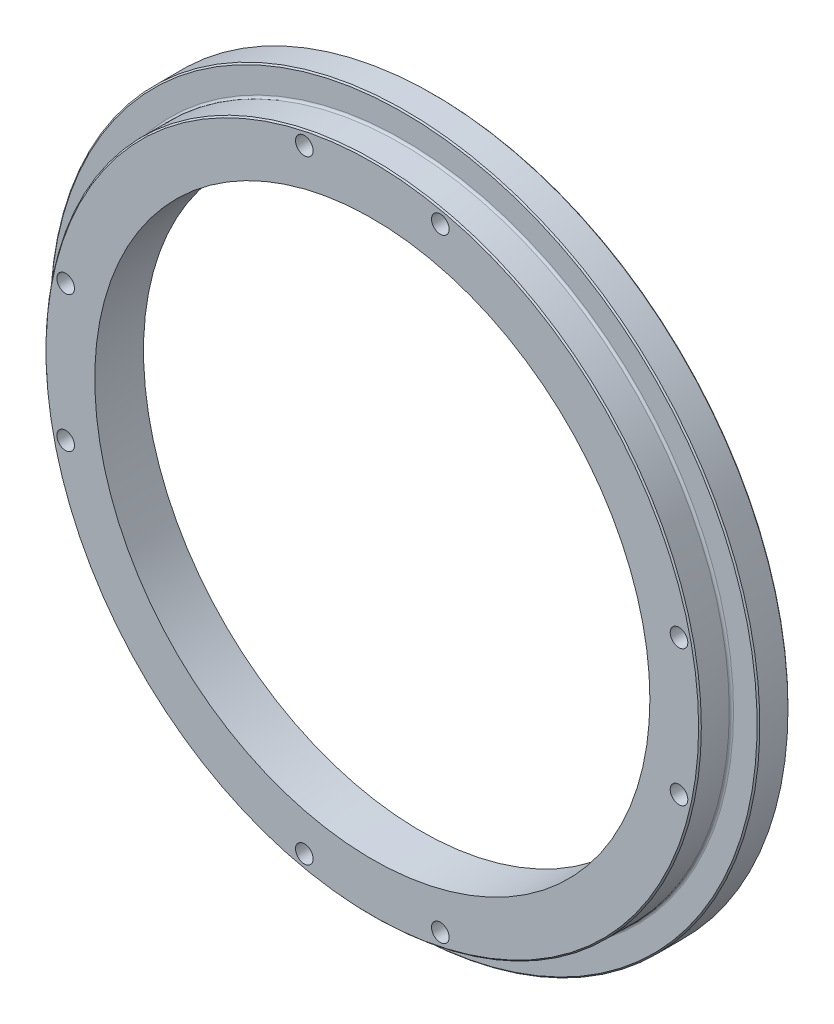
ISO-10303-21;
HEADER;
FILE_DESCRIPTION(('STEP AP214'),'2;1');
FILE_NAME('part.step','',(''),(''),'','','');
FILE_SCHEMA(('AUTOMOTIVE_DESIGN { 1 0 10303 214 1 1 1 1 }'));
ENDSEC;
DATA;
#1=APPLICATION_CONTEXT('core data for automotive mechanical design processes');
#2=APPLICATION_PROTOCOL_DEFINITION('international standard','automotive_design',2000,#1);
#3=PRODUCT_CONTEXT('',#1,'mechanical');
#4=PRODUCT('Part','Part','',(#3));
#5=PRODUCT_RELATED_PRODUCT_CATEGORY('part','',(#4));
#6=PRODUCT_DEFINITION_FORMATION('','',#4);
#7=PRODUCT_DEFINITION_CONTEXT('part definition',#1,'design');
#8=PRODUCT_DEFINITION('design','',#6,#7);
#9=PRODUCT_DEFINITION_SHAPE('','',#8);
#10=(LENGTH_UNIT() NAMED_UNIT(*) SI_UNIT(.MILLI.,.METRE.));
#11=(NAMED_UNIT(*) PLANE_ANGLE_UNIT() SI_UNIT($,.RADIAN.));
#12=(NAMED_UNIT(*) SI_UNIT($,.STERADIAN.) SOLID_ANGLE_UNIT());
#13=UNCERTAINTY_MEASURE_WITH_UNIT(LENGTH_MEASURE(1.E-05),#10,'distance_accuracy_value','');
#14=(GEOMETRIC_REPRESENTATION_CONTEXT(3) GLOBAL_UNCERTAINTY_ASSIGNED_CONTEXT((#13)) GLOBAL_UNIT_ASSIGNED_CONTEXT((#10,
#11,#12)) REPRESENTATION_CONTEXT('',''));
#15=CARTESIAN_POINT('',(0.,0.,0.));
#16=DIRECTION('',(0.,0.,1.));
#17=DIRECTION('',(1.,0.,0.));
#18=AXIS2_PLACEMENT_3D('',#15,#16,#17);
#19=CARTESIAN_POINT('',(0.,0.,23.));
#20=DIRECTION('',(0.,0.,-1.));
#21=DIRECTION('',(-1.,0.,0.));
#22=AXIS2_PLACEMENT_3D('',#19,#20,#21);
#23=CYLINDRICAL_SURFACE('',#22,121.);
#24=CARTESIAN_POINT('',(0.,0.,22.5000000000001));
#25=DIRECTION('',(0.,0.,1.));
#26=DIRECTION('',(1.,0.,0.));
#27=AXIS2_PLACEMENT_3D('',#24,#25,#26);
#28=CIRCLE('',#27,121.);
#29=CARTESIAN_POINT('',(121.,0.,22.5000000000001));
#30=VERTEX_POINT('',#29);
#31=EDGE_CURVE('E10',#30,#30,#28,.F.);
#32=ORIENTED_EDGE('',*,*,#31,.T.);
#33=EDGE_LOOP('',(#32));
#34=FACE_BOUND('',#33,.T.);
#35=CARTESIAN_POINT('',(0.,0.,12.2));
#36=DIRECTION('',(0.,0.,-1.));
#37=DIRECTION('',(-1.,0.,0.));
#38=AXIS2_PLACEMENT_3D('',#35,#36,#37);
#39=CIRCLE('',#38,121.);
#40=CARTESIAN_POINT('',(-121.,0.,12.2));
#41=VERTEX_POINT('',#40);
#42=EDGE_CURVE('E64',#41,#41,#39,.F.);
#43=ORIENTED_EDGE('',*,*,#42,.T.);
#44=EDGE_LOOP('',(#43));
#45=FACE_BOUND('',#44,.T.);
#46=ADVANCED_FACE('F38',(#34,#45),#23,.T.);
#47=CARTESIAN_POINT('',(0.,0.,0.));
#48=DIRECTION('',(0.,0.,1.));
#49=DIRECTION('',(1.,0.,0.));
#50=AXIS2_PLACEMENT_3D('',#47,#48,#49);
#51=PLANE('',#50);
#52=CARTESIAN_POINT('',(0.,0.,0.));
#53=DIRECTION('',(0.,0.,1.));
#54=DIRECTION('',(1.,0.,0.));
#55=AXIS2_PLACEMENT_3D('',#52,#53,#54);
#56=CIRCLE('',#55,130.5);
#57=CARTESIAN_POINT('',(130.5,0.,0.));
#58=VERTEX_POINT('',#57);
#59=EDGE_CURVE('E61',#58,#58,#56,.F.);
#60=ORIENTED_EDGE('',*,*,#59,.T.);
#61=EDGE_LOOP('',(#60));
#62=FACE_BOUND('',#61,.T.);
#63=CARTESIAN_POINT('',(-25.10699521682,113.250336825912,0.));
#64=DIRECTION('',(0.,0.,1.));
#65=DIRECTION('',(1.,0.,0.));
#66=AXIS2_PLACEMENT_3D('',#63,#64,#65);
#67=CIRCLE('',#66,3.25000000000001);
#68=CARTESIAN_POINT('',(-21.85699521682,113.250336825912,0.));
#69=VERTEX_POINT('',#68);
#70=EDGE_CURVE('E73',#69,#69,#67,.T.);
#71=ORIENTED_EDGE('',*,*,#70,.T.);
#72=EDGE_LOOP('',(#71));
#73=FACE_BOUND('',#72,.T.);
#74=CARTESIAN_POINT('',(25.10699521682,113.250336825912,0.));
#75=DIRECTION('',(0.,0.,1.));
#76=DIRECTION('',(-1.,0.,0.));
#77=AXIS2_PLACEMENT_3D('',#74,#75,#76);
#78=CIRCLE('',#77,3.25000000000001);
#79=CARTESIAN_POINT('',(21.85699521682,113.250336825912,0.));
#80=VERTEX_POINT('',#79);
#81=EDGE_CURVE('E77',#80,#80,#78,.T.);
#82=ORIENTED_EDGE('',*,*,#81,.T.);
#83=EDGE_LOOP('',(#82));
#84=FACE_BOUND('',#83,.T.);
#85=CARTESIAN_POINT('',(113.250336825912,25.1069952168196,0.));
#86=DIRECTION('',(0.,0.,1.));
#87=DIRECTION('',(0.,-1.,0.));
#88=AXIS2_PLACEMENT_3D('',#85,#86,#87);
#89=CIRCLE('',#88,3.25000000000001);
#90=CARTESIAN_POINT('',(113.250336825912,21.8569952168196,0.));
#91=VERTEX_POINT('',#90);
#92=EDGE_CURVE('E83',#91,#91,#89,.T.);
#93=ORIENTED_EDGE('',*,*,#92,.T.);
#94=EDGE_LOOP('',(#93));
#95=FACE_BOUND('',#94,.T.);
#96=CARTESIAN_POINT('',(113.250336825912,-25.1069952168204,0.));
#97=DIRECTION('',(0.,0.,1.));
#98=DIRECTION('',(0.,1.,0.));
#99=AXIS2_PLACEMENT_3D('',#96,#97,#98);
#100=CIRCLE('',#99,3.25000000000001);
#101=CARTESIAN_POINT('',(113.250336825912,-21.8569952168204,0.));
#102=VERTEX_POINT('',#101);
#103=EDGE_CURVE('E89',#102,#102,#100,.T.);
#104=ORIENTED_EDGE('',*,*,#103,.T.);
#105=EDGE_LOOP('',(#104));
#106=FACE_BOUND('',#105,.T.);
#107=CARTESIAN_POINT('',(25.1069952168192,-113.250336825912,0.));
#108=DIRECTION('',(0.,0.,1.));
#109=DIRECTION('',(-1.,0.,0.));
#110=AXIS2_PLACEMENT_3D('',#107,#108,#109);
#111=CIRCLE('',#110,3.25000000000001);
#112=CARTESIAN_POINT('',(21.8569952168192,-113.250336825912,0.));
#113=VERTEX_POINT('',#112);
#114=EDGE_CURVE('E95',#113,#113,#111,.T.);
#115=ORIENTED_EDGE('',*,*,#114,.T.);
#116=EDGE_LOOP('',(#115));
#117=FACE_BOUND('',#116,.T.);
#118=CARTESIAN_POINT('',(-25.1069952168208,-113.250336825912,0.));
#119=DIRECTION('',(0.,0.,1.));
#120=DIRECTION('',(1.,0.,0.));
#121=AXIS2_PLACEMENT_3D('',#118,#119,#120);
#122=CIRCLE('',#121,3.25000000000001);
#123=CARTESIAN_POINT('',(-21.8569952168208,-113.250336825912,0.));
#124=VERTEX_POINT('',#123);
#125=EDGE_CURVE('E101',#124,#124,#122,.T.);
#126=ORIENTED_EDGE('',*,*,#125,.T.);
#127=EDGE_LOOP('',(#126));
#128=FACE_BOUND('',#127,.T.);
#129=CARTESIAN_POINT('',(-113.250336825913,-25.1069952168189,0.));
#130=DIRECTION('',(0.,0.,1.));
#131=DIRECTION('',(0.,1.,0.));
#132=AXIS2_PLACEMENT_3D('',#129,#130,#131);
#133=CIRCLE('',#132,3.25000000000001);
#134=CARTESIAN_POINT('',(-113.250336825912,-21.8569952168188,0.));
#135=VERTEX_POINT('',#134);
#136=EDGE_CURVE('E107',#135,#135,#133,.T.);
#137=ORIENTED_EDGE('',*,*,#136,.T.);
#138=EDGE_LOOP('',(#137));
#139=FACE_BOUND('',#138,.T.);
#140=CARTESIAN_POINT('',(-113.250336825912,25.1069952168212,0.));
#141=DIRECTION('',(0.,0.,1.));
#142=DIRECTION('',(0.,-1.,0.));
#143=AXIS2_PLACEMENT_3D('',#140,#141,#142);
#144=CIRCLE('',#143,3.25000000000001);
#145=CARTESIAN_POINT('',(-113.250336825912,21.8569952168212,0.));
#146=VERTEX_POINT('',#145);
#147=EDGE_CURVE('E113',#146,#146,#144,.T.);
#148=ORIENTED_EDGE('',*,*,#147,.T.);
#149=EDGE_LOOP('',(#148));
#150=FACE_BOUND('',#149,.T.);
#151=CARTESIAN_POINT('',(0.,0.,0.));
#152=DIRECTION('',(0.,0.,1.));
#153=DIRECTION('',(1.,0.,0.));
#154=AXIS2_PLACEMENT_3D('',#151,#152,#153);
#155=CIRCLE('',#154,109.75);
#156=CARTESIAN_POINT('',(109.75,0.,0.));
#157=VERTEX_POINT('',#156);
#158=EDGE_CURVE('E122',#157,#157,#155,.T.);
#159=ORIENTED_EDGE('',*,*,#158,.T.);
#160=EDGE_LOOP('',(#159));
#161=FACE_BOUND('',#160,.T.);
#162=ADVANCED_FACE('F142',(#62,#73,#84,#95,#106,#117,#128,#139,#150,#161),#51,.F.);
#163=CARTESIAN_POINT('',(0.,0.,23.));
#164=DIRECTION('',(0.,0.,1.));
#165=DIRECTION('',(1.,0.,0.));
#166=AXIS2_PLACEMENT_3D('',#163,#164,#165);
#167=PLANE('',#166);
#168=CARTESIAN_POINT('',(0.,0.,23.));
#169=DIRECTION('',(0.,0.,1.));
#170=DIRECTION('',(1.,0.,0.));
#171=AXIS2_PLACEMENT_3D('',#168,#169,#170);
#172=CIRCLE('',#171,120.5);
#173=CARTESIAN_POINT('',(120.5,0.,23.));
#174=VERTEX_POINT('',#173);
#175=EDGE_CURVE('E45',#174,#174,#172,.T.);
#176=ORIENTED_EDGE('',*,*,#175,.T.);
#177=EDGE_LOOP('',(#176));
#178=FACE_BOUND('',#177,.T.);
#179=CARTESIAN_POINT('',(-113.250336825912,25.1069952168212,23.));
#180=DIRECTION('',(0.,0.,1.));
#181=DIRECTION('',(0.,-1.,0.));
#182=AXIS2_PLACEMENT_3D('',#179,#180,#181);
#183=CIRCLE('',#182,3.25000000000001);
#184=CARTESIAN_POINT('',(-113.250336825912,21.8569952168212,23.));
#185=VERTEX_POINT('',#184);
#186=EDGE_CURVE('E116',#185,#185,#183,.T.);
#187=ORIENTED_EDGE('',*,*,#186,.F.);
#188=EDGE_LOOP('',(#187));
#189=FACE_BOUND('',#188,.T.);
#190=CARTESIAN_POINT('',(-113.250336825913,-25.1069952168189,23.));
#191=DIRECTION('',(0.,0.,1.));
#192=DIRECTION('',(0.,1.,0.));
#193=AXIS2_PLACEMENT_3D('',#190,#191,#192);
#194=CIRCLE('',#193,3.25000000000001);
#195=CARTESIAN_POINT('',(-113.250336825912,-21.8569952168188,23.));
#196=VERTEX_POINT('',#195);
#197=EDGE_CURVE('E110',#196,#196,#194,.T.);
#198=ORIENTED_EDGE('',*,*,#197,.F.);
#199=EDGE_LOOP('',(#198));
#200=FACE_BOUND('',#199,.T.);
#201=CARTESIAN_POINT('',(-25.1069952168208,-113.250336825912,23.));
#202=DIRECTION('',(0.,0.,1.));
#203=DIRECTION('',(1.,0.,0.));
#204=AXIS2_PLACEMENT_3D('',#201,#202,#203);
#205=CIRCLE('',#204,3.25000000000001);
#206=CARTESIAN_POINT('',(-21.8569952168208,-113.250336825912,23.));
#207=VERTEX_POINT('',#206);
#208=EDGE_CURVE('E104',#207,#207,#205,.T.);
#209=ORIENTED_EDGE('',*,*,#208,.F.);
#210=EDGE_LOOP('',(#209));
#211=FACE_BOUND('',#210,.T.);
#212=CARTESIAN_POINT('',(25.1069952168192,-113.250336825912,23.));
#213=DIRECTION('',(0.,0.,1.));
#214=DIRECTION('',(-1.,0.,0.));
#215=AXIS2_PLACEMENT_3D('',#212,#213,#214);
#216=CIRCLE('',#215,3.25000000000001);
#217=CARTESIAN_POINT('',(21.8569952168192,-113.250336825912,23.));
#218=VERTEX_POINT('',#217);
#219=EDGE_CURVE('E98',#218,#218,#216,.T.);
#220=ORIENTED_EDGE('',*,*,#219,.F.);
#221=EDGE_LOOP('',(#220));
#222=FACE_BOUND('',#221,.T.);
#223=CARTESIAN_POINT('',(113.250336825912,-25.1069952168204,23.));
#224=DIRECTION('',(0.,0.,1.));
#225=DIRECTION('',(0.,1.,0.));
#226=AXIS2_PLACEMENT_3D('',#223,#224,#225);
#227=CIRCLE('',#226,3.25000000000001);
#228=CARTESIAN_POINT('',(113.250336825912,-21.8569952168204,23.));
#229=VERTEX_POINT('',#228);
#230=EDGE_CURVE('E92',#229,#229,#227,.T.);
#231=ORIENTED_EDGE('',*,*,#230,.F.);
#232=EDGE_LOOP('',(#231));
#233=FACE_BOUND('',#232,.T.);
#234=CARTESIAN_POINT('',(113.250336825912,25.1069952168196,23.));
#235=DIRECTION('',(0.,0.,1.));
#236=DIRECTION('',(0.,-1.,0.));
#237=AXIS2_PLACEMENT_3D('',#234,#235,#236);
#238=CIRCLE('',#237,3.25000000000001);
#239=CARTESIAN_POINT('',(113.250336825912,21.8569952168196,23.));
#240=VERTEX_POINT('',#239);
#241=EDGE_CURVE('E86',#240,#240,#238,.T.);
#242=ORIENTED_EDGE('',*,*,#241,.F.);
#243=EDGE_LOOP('',(#242));
#244=FACE_BOUND('',#243,.T.);
#245=CARTESIAN_POINT('',(25.10699521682,113.250336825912,23.));
#246=DIRECTION('',(0.,0.,1.));
#247=DIRECTION('',(-1.,0.,0.));
#248=AXIS2_PLACEMENT_3D('',#245,#246,#247);
#249=CIRCLE('',#248,3.25000000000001);
#250=CARTESIAN_POINT('',(21.85699521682,113.250336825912,23.));
#251=VERTEX_POINT('',#250);
#252=EDGE_CURVE('E80',#251,#251,#249,.T.);
#253=ORIENTED_EDGE('',*,*,#252,.F.);
#254=EDGE_LOOP('',(#253));
#255=FACE_BOUND('',#254,.T.);
#256=CARTESIAN_POINT('',(-25.10699521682,113.250336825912,23.));
#257=DIRECTION('',(0.,0.,1.));
#258=DIRECTION('',(1.,0.,0.));
#259=AXIS2_PLACEMENT_3D('',#256,#257,#258);
#260=CIRCLE('',#259,3.25000000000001);
#261=CARTESIAN_POINT('',(-21.85699521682,113.250336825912,23.));
#262=VERTEX_POINT('',#261);
#263=EDGE_CURVE('E74',#262,#262,#260,.T.);
#264=ORIENTED_EDGE('',*,*,#263,.F.);
#265=EDGE_LOOP('',(#264));
#266=FACE_BOUND('',#265,.T.);
#267=CARTESIAN_POINT('',(0.,0.,23.));
#268=DIRECTION('',(0.,0.,1.));
#269=DIRECTION('',(1.,0.,0.));
#270=AXIS2_PLACEMENT_3D('',#267,#268,#269);
#271=CIRCLE('',#270,102.5);
#272=CARTESIAN_POINT('',(102.5,0.,23.));
#273=VERTEX_POINT('',#272);
#274=EDGE_CURVE('E70',#273,#273,#271,.T.);
#275=ORIENTED_EDGE('',*,*,#274,.F.);
#276=EDGE_LOOP('',(#275));
#277=FACE_BOUND('',#276,.T.);
#278=ADVANCED_FACE('F137',(#178,#189,#200,#211,#222,#233,#244,#255,#266,#277),#167,.T.);
#279=CARTESIAN_POINT('',(0.,0.,23.));
#280=DIRECTION('',(0.,0.,-1.));
#281=DIRECTION('',(-1.,0.,0.));
#282=AXIS2_PLACEMENT_3D('',#279,#280,#281);
#283=CYLINDRICAL_SURFACE('',#282,102.5);
#284=CARTESIAN_POINT('',(0.,0.,5.));
#285=DIRECTION('',(0.,0.,1.));
#286=DIRECTION('',(1.,0.,0.));
#287=AXIS2_PLACEMENT_3D('',#284,#285,#286);
#288=CIRCLE('',#287,102.5);
#289=CARTESIAN_POINT('',(102.5,0.,5.));
#290=VERTEX_POINT('',#289);
#291=EDGE_CURVE('E125',#290,#290,#288,.T.);
#292=ORIENTED_EDGE('',*,*,#291,.F.);
#293=EDGE_LOOP('',(#292));
#294=FACE_BOUND('',#293,.T.);
#295=ORIENTED_EDGE('',*,*,#274,.T.);
#296=EDGE_LOOP('',(#295));
#297=FACE_BOUND('',#296,.T.);
#298=ADVANCED_FACE('F133',(#294,#297),#283,.F.);
#299=CARTESIAN_POINT('',(-25.10699521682,113.250336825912,0.));
#300=DIRECTION('',(0.,0.,1.));
#301=DIRECTION('',(1.,0.,0.));
#302=AXIS2_PLACEMENT_3D('',#299,#300,#301);
#303=CYLINDRICAL_SURFACE('',#302,3.25000000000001);
#304=ORIENTED_EDGE('',*,*,#70,.F.);
#305=EDGE_LOOP('',(#304));
#306=FACE_BOUND('',#305,.T.);
#307=ORIENTED_EDGE('',*,*,#263,.T.);
#308=EDGE_LOOP('',(#307));
#309=FACE_BOUND('',#308,.T.);
#310=ADVANCED_FACE('F136',(#306,#309),#303,.F.);
#311=CARTESIAN_POINT('',(25.10699521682,113.250336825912,0.));
#312=DIRECTION('',(0.,0.,1.));
#313=DIRECTION('',(1.,0.,0.));
#314=AXIS2_PLACEMENT_3D('',#311,#312,#313);
#315=CYLINDRICAL_SURFACE('',#314,3.25000000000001);
#316=ORIENTED_EDGE('',*,*,#81,.F.);
#317=EDGE_LOOP('',(#316));
#318=FACE_BOUND('',#317,.T.);
#319=ORIENTED_EDGE('',*,*,#252,.T.);
#320=EDGE_LOOP('',(#319));
#321=FACE_BOUND('',#320,.T.);
#322=ADVANCED_FACE('F215',(#318,#321),#315,.F.);
#323=CARTESIAN_POINT('',(113.250336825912,25.1069952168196,0.));
#324=DIRECTION('',(0.,0.,1.));
#325=DIRECTION('',(1.,0.,0.));
#326=AXIS2_PLACEMENT_3D('',#323,#324,#325);
#327=CYLINDRICAL_SURFACE('',#326,3.25000000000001);
#328=ORIENTED_EDGE('',*,*,#92,.F.);
#329=EDGE_LOOP('',(#328));
#330=FACE_BOUND('',#329,.T.);
#331=ORIENTED_EDGE('',*,*,#241,.T.);
#332=EDGE_LOOP('',(#331));
#333=FACE_BOUND('',#332,.T.);
#334=ADVANCED_FACE('F211',(#330,#333),#327,.F.);
#335=CARTESIAN_POINT('',(113.250336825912,-25.1069952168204,0.));
#336=DIRECTION('',(0.,0.,1.));
#337=DIRECTION('',(1.,0.,0.));
#338=AXIS2_PLACEMENT_3D('',#335,#336,#337);
#339=CYLINDRICAL_SURFACE('',#338,3.25000000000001);
#340=ORIENTED_EDGE('',*,*,#103,.F.);
#341=EDGE_LOOP('',(#340));
#342=FACE_BOUND('',#341,.T.);
#343=ORIENTED_EDGE('',*,*,#230,.T.);
#344=EDGE_LOOP('',(#343));
#345=FACE_BOUND('',#344,.T.);
#346=ADVANCED_FACE('F207',(#342,#345),#339,.F.);
#347=CARTESIAN_POINT('',(25.1069952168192,-113.250336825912,0.));
#348=DIRECTION('',(0.,0.,1.));
#349=DIRECTION('',(1.,0.,0.));
#350=AXIS2_PLACEMENT_3D('',#347,#348,#349);
#351=CYLINDRICAL_SURFACE('',#350,3.25000000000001);
#352=ORIENTED_EDGE('',*,*,#114,.F.);
#353=EDGE_LOOP('',(#352));
#354=FACE_BOUND('',#353,.T.);
#355=ORIENTED_EDGE('',*,*,#219,.T.);
#356=EDGE_LOOP('',(#355));
#357=FACE_BOUND('',#356,.T.);
#358=ADVANCED_FACE('F203',(#354,#357),#351,.F.);
#359=CARTESIAN_POINT('',(-25.1069952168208,-113.250336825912,0.));
#360=DIRECTION('',(0.,0.,1.));
#361=DIRECTION('',(1.,0.,0.));
#362=AXIS2_PLACEMENT_3D('',#359,#360,#361);
#363=CYLINDRICAL_SURFACE('',#362,3.25000000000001);
#364=ORIENTED_EDGE('',*,*,#125,.F.);
#365=EDGE_LOOP('',(#364));
#366=FACE_BOUND('',#365,.T.);
#367=ORIENTED_EDGE('',*,*,#208,.T.);
#368=EDGE_LOOP('',(#367));
#369=FACE_BOUND('',#368,.T.);
#370=ADVANCED_FACE('F199',(#366,#369),#363,.F.);
#371=CARTESIAN_POINT('',(-113.250336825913,-25.1069952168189,0.));
#372=DIRECTION('',(0.,0.,1.));
#373=DIRECTION('',(1.,0.,0.));
#374=AXIS2_PLACEMENT_3D('',#371,#372,#373);
#375=CYLINDRICAL_SURFACE('',#374,3.25000000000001);
#376=ORIENTED_EDGE('',*,*,#136,.F.);
#377=EDGE_LOOP('',(#376));
#378=FACE_BOUND('',#377,.T.);
#379=ORIENTED_EDGE('',*,*,#197,.T.);
#380=EDGE_LOOP('',(#379));
#381=FACE_BOUND('',#380,.T.);
#382=ADVANCED_FACE('F195',(#378,#381),#375,.F.);
#383=CARTESIAN_POINT('',(-113.250336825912,25.1069952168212,0.));
#384=DIRECTION('',(0.,0.,1.));
#385=DIRECTION('',(1.,0.,0.));
#386=AXIS2_PLACEMENT_3D('',#383,#384,#385);
#387=CYLINDRICAL_SURFACE('',#386,3.25000000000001);
#388=ORIENTED_EDGE('',*,*,#147,.F.);
#389=EDGE_LOOP('',(#388));
#390=FACE_BOUND('',#389,.T.);
#391=ORIENTED_EDGE('',*,*,#186,.T.);
#392=EDGE_LOOP('',(#391));
#393=FACE_BOUND('',#392,.T.);
#394=ADVANCED_FACE('F190',(#390,#393),#387,.F.);
#395=CARTESIAN_POINT('',(0.,0.,5.));
#396=DIRECTION('',(0.,0.,1.));
#397=DIRECTION('',(1.,0.,0.));
#398=AXIS2_PLACEMENT_3D('',#395,#396,#397);
#399=PLANE('',#398);
#400=CARTESIAN_POINT('',(0.,0.,5.));
#401=DIRECTION('',(0.,0.,1.));
#402=DIRECTION('',(1.,0.,0.));
#403=AXIS2_PLACEMENT_3D('',#400,#401,#402);
#404=CIRCLE('',#403,109.75);
#405=CARTESIAN_POINT('',(109.75,0.,5.));
#406=VERTEX_POINT('',#405);
#407=EDGE_CURVE('E119',#406,#406,#404,.T.);
#408=ORIENTED_EDGE('',*,*,#407,.F.);
#409=EDGE_LOOP('',(#408));
#410=FACE_BOUND('',#409,.T.);
#411=ORIENTED_EDGE('',*,*,#291,.T.);
#412=EDGE_LOOP('',(#411));
#413=FACE_BOUND('',#412,.T.);
#414=ADVANCED_FACE('F131',(#410,#413),#399,.F.);
#415=CARTESIAN_POINT('',(0.,0.,5.));
#416=DIRECTION('',(0.,0.,-1.));
#417=DIRECTION('',(-1.,0.,0.));
#418=AXIS2_PLACEMENT_3D('',#415,#416,#417);
#419=CYLINDRICAL_SURFACE('',#418,109.75);
#420=ORIENTED_EDGE('',*,*,#407,.T.);
#421=EDGE_LOOP('',(#420));
#422=FACE_BOUND('',#421,.T.);
#423=ORIENTED_EDGE('',*,*,#158,.F.);
#424=EDGE_LOOP('',(#423));
#425=FACE_BOUND('',#424,.T.);
#426=ADVANCED_FACE('F177',(#422,#425),#419,.F.);
#427=CARTESIAN_POINT('',(0.,0.,11.4));
#428=DIRECTION('',(0.,0.,-1.));
#429=DIRECTION('',(-1.,0.,0.));
#430=AXIS2_PLACEMENT_3D('',#427,#428,#429);
#431=CYLINDRICAL_SURFACE('',#430,131.);
#432=CARTESIAN_POINT('',(0.,0.,0.500000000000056));
#433=DIRECTION('',(0.,0.,1.));
#434=DIRECTION('',(1.,0.,0.));
#435=AXIS2_PLACEMENT_3D('',#432,#433,#434);
#436=CIRCLE('',#435,131.);
#437=CARTESIAN_POINT('',(131.,0.,0.500000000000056));
#438=VERTEX_POINT('',#437);
#439=EDGE_CURVE('E53',#438,#438,#436,.T.);
#440=ORIENTED_EDGE('',*,*,#439,.T.);
#441=EDGE_LOOP('',(#440));
#442=FACE_BOUND('',#441,.T.);
#443=CARTESIAN_POINT('',(0.,0.,10.9));
#444=DIRECTION('',(0.,0.,-1.));
#445=DIRECTION('',(-1.,0.,0.));
#446=AXIS2_PLACEMENT_3D('',#443,#444,#445);
#447=CIRCLE('',#446,131.);
#448=CARTESIAN_POINT('',(-131.,0.,10.9));
#449=VERTEX_POINT('',#448);
#450=EDGE_CURVE('E58',#449,#449,#447,.T.);
#451=ORIENTED_EDGE('',*,*,#450,.T.);
#452=EDGE_LOOP('',(#451));
#453=FACE_BOUND('',#452,.T.);
#454=ADVANCED_FACE('F175',(#442,#453),#431,.T.);
#455=CARTESIAN_POINT('',(0.,0.,11.4));
#456=DIRECTION('',(0.,0.,-1.));
#457=DIRECTION('',(-1.,0.,0.));
#458=AXIS2_PLACEMENT_3D('',#455,#456,#457);
#459=PLANE('',#458);
#460=CARTESIAN_POINT('',(0.,0.,11.4));
#461=DIRECTION('',(0.,0.,-1.));
#462=DIRECTION('',(-1.,0.,0.));
#463=AXIS2_PLACEMENT_3D('',#460,#461,#462);
#464=CIRCLE('',#463,130.5);
#465=CARTESIAN_POINT('',(-130.5,0.,11.4));
#466=VERTEX_POINT('',#465);
#467=EDGE_CURVE('E49',#466,#466,#464,.F.);
#468=ORIENTED_EDGE('',*,*,#467,.T.);
#469=EDGE_LOOP('',(#468));
#470=FACE_BOUND('',#469,.T.);
#471=CARTESIAN_POINT('',(0.,0.,11.4));
#472=DIRECTION('',(0.,0.,-1.));
#473=DIRECTION('',(-1.,0.,0.));
#474=AXIS2_PLACEMENT_3D('',#471,#472,#473);
#475=CIRCLE('',#474,121.8);
#476=CARTESIAN_POINT('',(-121.8,0.,11.4));
#477=VERTEX_POINT('',#476);
#478=EDGE_CURVE('E67',#477,#477,#475,.T.);
#479=ORIENTED_EDGE('',*,*,#478,.T.);
#480=EDGE_LOOP('',(#479));
#481=FACE_BOUND('',#480,.T.);
#482=ADVANCED_FACE('F160',(#470,#481),#459,.F.);
#483=CARTESIAN_POINT('',(0.,0.,12.2));
#484=DIRECTION('',(0.,0.,-1.));
#485=DIRECTION('',(-1.,0.,0.));
#486=AXIS2_PLACEMENT_3D('',#483,#484,#485);
#487=TOROIDAL_SURFACE('',#486,121.8,0.8);
#488=ORIENTED_EDGE('',*,*,#42,.F.);
#489=EDGE_LOOP('',(#488));
#490=FACE_BOUND('',#489,.T.);
#491=ORIENTED_EDGE('',*,*,#478,.F.);
#492=EDGE_LOOP('',(#491));
#493=FACE_BOUND('',#492,.T.);
#494=ADVANCED_FACE('F156',(#490,#493),#487,.F.);
#495=CARTESIAN_POINT('',(0.,0.,0.));
#496=DIRECTION('',(0.,0.,1.));
#497=DIRECTION('',(1.,0.,0.));
#498=AXIS2_PLACEMENT_3D('',#495,#496,#497);
#499=CONICAL_SURFACE('',#498,130.5,0.785398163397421);
#500=ORIENTED_EDGE('',*,*,#439,.F.);
#501=EDGE_LOOP('',(#500));
#502=FACE_BOUND('',#501,.T.);
#503=ORIENTED_EDGE('',*,*,#59,.F.);
#504=EDGE_LOOP('',(#503));
#505=FACE_BOUND('',#504,.T.);
#506=ADVANCED_FACE('F159',(#502,#505),#499,.T.);
#507=CARTESIAN_POINT('',(0.,0.,10.9));
#508=DIRECTION('',(0.,0.,-1.));
#509=DIRECTION('',(-1.,0.,0.));
#510=AXIS2_PLACEMENT_3D('',#507,#508,#509);
#511=CONICAL_SURFACE('',#510,131.,0.785398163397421);
#512=ORIENTED_EDGE('',*,*,#467,.F.);
#513=EDGE_LOOP('',(#512));
#514=FACE_BOUND('',#513,.T.);
#515=ORIENTED_EDGE('',*,*,#450,.F.);
#516=EDGE_LOOP('',(#515));
#517=FACE_BOUND('',#516,.T.);
#518=ADVANCED_FACE('F163',(#514,#517),#511,.T.);
#519=CARTESIAN_POINT('',(0.,0.,23.));
#520=DIRECTION('',(0.,0.,-1.));
#521=DIRECTION('',(-1.,0.,0.));
#522=AXIS2_PLACEMENT_3D('',#519,#520,#521);
#523=CONICAL_SURFACE('',#522,120.5,0.785398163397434);
#524=ORIENTED_EDGE('',*,*,#31,.F.);
#525=EDGE_LOOP('',(#524));
#526=FACE_BOUND('',#525,.T.);
#527=ORIENTED_EDGE('',*,*,#175,.F.);
#528=EDGE_LOOP('',(#527));
#529=FACE_BOUND('',#528,.T.);
#530=ADVANCED_FACE('F40',(#526,#529),#523,.T.);
#531=CLOSED_SHELL('',(#46,#162,#278,#298,#310,#322,#334,#346,#358,#370,#382,#394,#414,#426,#454,
#482,#494,#506,#518,#530));
#532=MANIFOLD_SOLID_BREP('B2',#531);
#533=ADVANCED_BREP_SHAPE_REPRESENTATION('',(#18,#532),#14);
#534=SHAPE_DEFINITION_REPRESENTATION(#9,#533);
ENDSEC;
END-ISO-10303-21;
